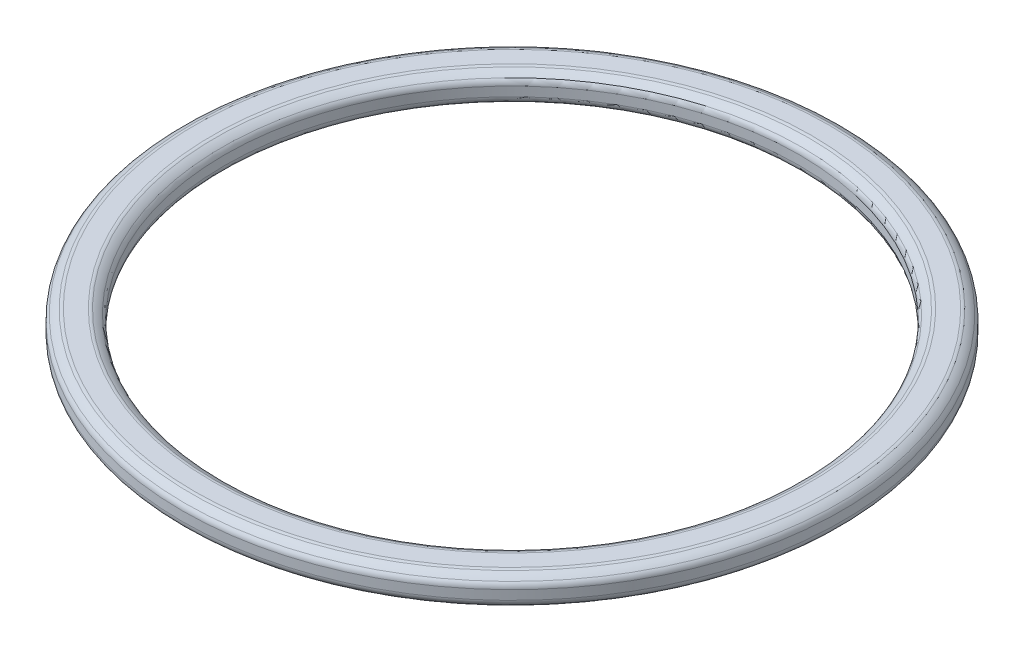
ISO-10303-21;
HEADER;
FILE_DESCRIPTION(('STEP AP214'),'2;1');
FILE_NAME('part.step','',(''),(''),'','','');
FILE_SCHEMA(('AUTOMOTIVE_DESIGN { 1 0 10303 214 1 1 1 1 }'));
ENDSEC;
DATA;
#1=APPLICATION_CONTEXT('core data for automotive mechanical design processes');
#2=APPLICATION_PROTOCOL_DEFINITION('international standard','automotive_design',2000,#1);
#3=PRODUCT_CONTEXT('',#1,'mechanical');
#4=PRODUCT('Part','Part','',(#3));
#5=PRODUCT_RELATED_PRODUCT_CATEGORY('part','',(#4));
#6=PRODUCT_DEFINITION_FORMATION('','',#4);
#7=PRODUCT_DEFINITION_CONTEXT('part definition',#1,'design');
#8=PRODUCT_DEFINITION('design','',#6,#7);
#9=PRODUCT_DEFINITION_SHAPE('','',#8);
#10=(LENGTH_UNIT() NAMED_UNIT(*) SI_UNIT(.MILLI.,.METRE.));
#11=(NAMED_UNIT(*) PLANE_ANGLE_UNIT() SI_UNIT($,.RADIAN.));
#12=(NAMED_UNIT(*) SI_UNIT($,.STERADIAN.) SOLID_ANGLE_UNIT());
#13=UNCERTAINTY_MEASURE_WITH_UNIT(LENGTH_MEASURE(1.E-05),#10,'distance_accuracy_value','');
#14=(GEOMETRIC_REPRESENTATION_CONTEXT(3) GLOBAL_UNCERTAINTY_ASSIGNED_CONTEXT((#13)) GLOBAL_UNIT_ASSIGNED_CONTEXT((#10,
#11,#12)) REPRESENTATION_CONTEXT('',''));
#15=CARTESIAN_POINT('',(0.,0.,0.));
#16=DIRECTION('',(0.,0.,1.));
#17=DIRECTION('',(1.,0.,0.));
#18=AXIS2_PLACEMENT_3D('',#15,#16,#17);
#19=CARTESIAN_POINT('',(14.6,0.72,0.));
#20=DIRECTION('',(0.,0.,1.));
#21=DIRECTION('',(1.,0.,0.));
#22=AXIS2_PLACEMENT_3D('',#19,#20,#21);
#23=ELLIPSE('',#22,1.11111111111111,0.8);
#24=CARTESIAN_POINT('',(0.,0.,0.));
#25=DIRECTION('',(0.,-1.,0.));
#26=AXIS1_PLACEMENT('',#24,#25);
#27=SURFACE_OF_REVOLUTION('',#23,#26);
#28=CARTESIAN_POINT('',(0.,1.41226565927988,0.));
#29=DIRECTION('',(0.,-1.,0.));
#30=DIRECTION('',(0.,0.,-1.));
#31=AXIS2_PLACEMENT_3D('',#28,#29,#30);
#32=CIRCLE('',#31,15.1568877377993);
#33=CARTESIAN_POINT('',(0.,1.41226565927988,-15.1568877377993));
#34=VERTEX_POINT('',#33);
#35=EDGE_CURVE('E64',#34,#34,#32,.T.);
#36=ORIENTED_EDGE('',*,*,#35,.T.);
#37=EDGE_LOOP('',(#36));
#38=FACE_BOUND('',#37,.T.);
#39=CARTESIAN_POINT('',(0.,1.19931669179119,0.));
#40=DIRECTION('',(0.,-1.,0.));
#41=DIRECTION('',(0.,0.,-1.));
#42=AXIS2_PLACEMENT_3D('',#39,#40,#41);
#43=CIRCLE('',#42,15.4895998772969);
#44=CARTESIAN_POINT('',(0.,1.19931669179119,-15.4895998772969));
#45=VERTEX_POINT('',#44);
#46=EDGE_CURVE('E67',#45,#45,#43,.F.);
#47=ORIENTED_EDGE('',*,*,#46,.T.);
#48=EDGE_LOOP('',(#47));
#49=FACE_BOUND('',#48,.T.);
#50=ADVANCED_FACE('F14',(#38,#49),#27,.F.);
#51=CARTESIAN_POINT('',(14.1156778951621,1.44,0.));
#52=DIRECTION('',(0.,1.,0.));
#53=DIRECTION('',(0.,0.,1.));
#54=AXIS2_PLACEMENT_3D('',#51,#52,#53);
#55=PLANE('',#54);
#56=CARTESIAN_POINT('',(0.,1.44,0.));
#57=DIRECTION('',(0.,1.,0.));
#58=DIRECTION('',(0.,0.,1.));
#59=AXIS2_PLACEMENT_3D('',#56,#57,#58);
#60=CIRCLE('',#59,15.0183253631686);
#61=CARTESIAN_POINT('',(0.,1.44,15.0183253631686));
#62=VERTEX_POINT('',#61);
#63=EDGE_CURVE('E58',#62,#62,#60,.T.);
#64=ORIENTED_EDGE('',*,*,#63,.T.);
#65=EDGE_LOOP('',(#64));
#66=FACE_BOUND('',#65,.T.);
#67=CARTESIAN_POINT('',(0.,1.44,0.));
#68=DIRECTION('',(0.,1.,0.));
#69=DIRECTION('',(0.,0.,1.));
#70=AXIS2_PLACEMENT_3D('',#67,#68,#69);
#71=CIRCLE('',#70,14.1816746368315);
#72=CARTESIAN_POINT('',(0.,1.44,14.1816746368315));
#73=VERTEX_POINT('',#72);
#74=EDGE_CURVE('E61',#73,#73,#71,.F.);
#75=ORIENTED_EDGE('',*,*,#74,.T.);
#76=EDGE_LOOP('',(#75));
#77=FACE_BOUND('',#76,.T.);
#78=ADVANCED_FACE('F96',(#66,#77),#55,.T.);
#79=CARTESIAN_POINT('',(14.6,0.72,0.));
#80=DIRECTION('',(0.,0.,1.));
#81=DIRECTION('',(1.,0.,0.));
#82=AXIS2_PLACEMENT_3D('',#79,#80,#81);
#83=ELLIPSE('',#82,1.11111111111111,0.8);
#84=CARTESIAN_POINT('',(0.,0.,0.));
#85=DIRECTION('',(0.,-1.,0.));
#86=AXIS1_PLACEMENT('',#84,#85);
#87=SURFACE_OF_REVOLUTION('',#83,#86);
#88=CARTESIAN_POINT('',(0.,1.41226565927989,0.));
#89=DIRECTION('',(0.,-1.,0.));
#90=DIRECTION('',(0.,0.,-1.));
#91=AXIS2_PLACEMENT_3D('',#88,#89,#90);
#92=CIRCLE('',#91,14.0431122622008);
#93=CARTESIAN_POINT('',(0.,1.41226565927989,-14.0431122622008));
#94=VERTEX_POINT('',#93);
#95=EDGE_CURVE('E52',#94,#94,#92,.F.);
#96=ORIENTED_EDGE('',*,*,#95,.T.);
#97=EDGE_LOOP('',(#96));
#98=FACE_BOUND('',#97,.T.);
#99=CARTESIAN_POINT('',(0.,1.19931669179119,0.));
#100=DIRECTION('',(0.,-1.,0.));
#101=DIRECTION('',(0.,0.,-1.));
#102=AXIS2_PLACEMENT_3D('',#99,#100,#101);
#103=CIRCLE('',#102,13.7104001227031);
#104=CARTESIAN_POINT('',(0.,1.19931669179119,-13.7104001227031));
#105=VERTEX_POINT('',#104);
#106=EDGE_CURVE('E55',#105,#105,#103,.T.);
#107=ORIENTED_EDGE('',*,*,#106,.T.);
#108=EDGE_LOOP('',(#107));
#109=FACE_BOUND('',#108,.T.);
#110=ADVANCED_FACE('F92',(#98,#109),#87,.F.);
#111=CARTESIAN_POINT('',(0.,0.,0.));
#112=DIRECTION('',(0.,-1.,0.));
#113=DIRECTION('',(0.,0.,-1.));
#114=AXIS2_PLACEMENT_3D('',#111,#112,#113);
#115=CYLINDRICAL_SURFACE('',#114,13.6);
#116=CARTESIAN_POINT('',(0.,0.939894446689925,0.));
#117=DIRECTION('',(0.,1.,0.));
#118=DIRECTION('',(0.,0.,1.));
#119=AXIS2_PLACEMENT_3D('',#116,#117,#118);
#120=CIRCLE('',#119,13.6);
#121=CARTESIAN_POINT('',(0.,0.939894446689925,13.6));
#122=VERTEX_POINT('',#121);
#123=EDGE_CURVE('E46',#122,#122,#120,.T.);
#124=ORIENTED_EDGE('',*,*,#123,.T.);
#125=EDGE_LOOP('',(#124));
#126=FACE_BOUND('',#125,.T.);
#127=CARTESIAN_POINT('',(0.,0.500105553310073,0.));
#128=DIRECTION('',(0.,1.,0.));
#129=DIRECTION('',(0.,0.,1.));
#130=AXIS2_PLACEMENT_3D('',#127,#128,#129);
#131=CIRCLE('',#130,13.6);
#132=CARTESIAN_POINT('',(0.,0.500105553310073,13.6));
#133=VERTEX_POINT('',#132);
#134=EDGE_CURVE('E49',#133,#133,#131,.F.);
#135=ORIENTED_EDGE('',*,*,#134,.T.);
#136=EDGE_LOOP('',(#135));
#137=FACE_BOUND('',#136,.T.);
#138=ADVANCED_FACE('F88',(#126,#137),#115,.F.);
#139=CARTESIAN_POINT('',(14.6,0.72,0.));
#140=DIRECTION('',(0.,0.,1.));
#141=DIRECTION('',(1.,0.,0.));
#142=AXIS2_PLACEMENT_3D('',#139,#140,#141);
#143=ELLIPSE('',#142,1.11111111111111,0.8);
#144=CARTESIAN_POINT('',(0.,0.,0.));
#145=DIRECTION('',(0.,-1.,0.));
#146=AXIS1_PLACEMENT('',#144,#145);
#147=SURFACE_OF_REVOLUTION('',#143,#146);
#148=CARTESIAN_POINT('',(0.,0.240683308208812,0.));
#149=DIRECTION('',(0.,-1.,0.));
#150=DIRECTION('',(0.,0.,-1.));
#151=AXIS2_PLACEMENT_3D('',#148,#149,#150);
#152=CIRCLE('',#151,13.7104001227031);
#153=CARTESIAN_POINT('',(0.,0.240683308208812,-13.7104001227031));
#154=VERTEX_POINT('',#153);
#155=EDGE_CURVE('E40',#154,#154,#152,.F.);
#156=ORIENTED_EDGE('',*,*,#155,.T.);
#157=EDGE_LOOP('',(#156));
#158=FACE_BOUND('',#157,.T.);
#159=CARTESIAN_POINT('',(0.,0.0277343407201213,0.));
#160=DIRECTION('',(0.,-1.,0.));
#161=DIRECTION('',(0.,0.,-1.));
#162=AXIS2_PLACEMENT_3D('',#159,#160,#161);
#163=CIRCLE('',#162,14.0431122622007);
#164=CARTESIAN_POINT('',(0.,0.0277343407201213,-14.0431122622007));
#165=VERTEX_POINT('',#164);
#166=EDGE_CURVE('E43',#165,#165,#163,.T.);
#167=ORIENTED_EDGE('',*,*,#166,.T.);
#168=EDGE_LOOP('',(#167));
#169=FACE_BOUND('',#168,.T.);
#170=ADVANCED_FACE('F84',(#158,#169),#147,.F.);
#171=CARTESIAN_POINT('',(14.1156778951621,0.,0.));
#172=DIRECTION('',(0.,-1.,0.));
#173=DIRECTION('',(0.,0.,-1.));
#174=AXIS2_PLACEMENT_3D('',#171,#172,#173);
#175=PLANE('',#174);
#176=CARTESIAN_POINT('',(0.,0.,0.));
#177=DIRECTION('',(0.,-1.,0.));
#178=DIRECTION('',(0.,0.,-1.));
#179=AXIS2_PLACEMENT_3D('',#176,#177,#178);
#180=CIRCLE('',#179,14.1816746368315);
#181=CARTESIAN_POINT('',(0.,0.,-14.1816746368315));
#182=VERTEX_POINT('',#181);
#183=EDGE_CURVE('E34',#182,#182,#180,.F.);
#184=ORIENTED_EDGE('',*,*,#183,.T.);
#185=EDGE_LOOP('',(#184));
#186=FACE_BOUND('',#185,.T.);
#187=CARTESIAN_POINT('',(0.,0.,0.));
#188=DIRECTION('',(0.,-1.,0.));
#189=DIRECTION('',(0.,0.,-1.));
#190=AXIS2_PLACEMENT_3D('',#187,#188,#189);
#191=CIRCLE('',#190,15.0183253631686);
#192=CARTESIAN_POINT('',(0.,0.,-15.0183253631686));
#193=VERTEX_POINT('',#192);
#194=EDGE_CURVE('E37',#193,#193,#191,.T.);
#195=ORIENTED_EDGE('',*,*,#194,.T.);
#196=EDGE_LOOP('',(#195));
#197=FACE_BOUND('',#196,.T.);
#198=ADVANCED_FACE('F80',(#186,#197),#175,.T.);
#199=CARTESIAN_POINT('',(14.6,0.72,0.));
#200=DIRECTION('',(0.,0.,1.));
#201=DIRECTION('',(1.,0.,0.));
#202=AXIS2_PLACEMENT_3D('',#199,#200,#201);
#203=ELLIPSE('',#202,1.11111111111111,0.8);
#204=CARTESIAN_POINT('',(0.,0.,0.));
#205=DIRECTION('',(0.,-1.,0.));
#206=AXIS1_PLACEMENT('',#204,#205);
#207=SURFACE_OF_REVOLUTION('',#203,#206);
#208=CARTESIAN_POINT('',(0.,0.0277343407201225,0.));
#209=DIRECTION('',(0.,-1.,0.));
#210=DIRECTION('',(0.,0.,-1.));
#211=AXIS2_PLACEMENT_3D('',#208,#209,#210);
#212=CIRCLE('',#211,15.1568877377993);
#213=CARTESIAN_POINT('',(0.,0.0277343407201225,-15.1568877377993));
#214=VERTEX_POINT('',#213);
#215=EDGE_CURVE('E25',#214,#214,#212,.F.);
#216=ORIENTED_EDGE('',*,*,#215,.T.);
#217=EDGE_LOOP('',(#216));
#218=FACE_BOUND('',#217,.T.);
#219=CARTESIAN_POINT('',(0.,0.240683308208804,0.));
#220=DIRECTION('',(0.,-1.,0.));
#221=DIRECTION('',(0.,0.,-1.));
#222=AXIS2_PLACEMENT_3D('',#219,#220,#221);
#223=CIRCLE('',#222,15.4895998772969);
#224=CARTESIAN_POINT('',(0.,0.240683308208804,-15.4895998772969));
#225=VERTEX_POINT('',#224);
#226=EDGE_CURVE('E29',#225,#225,#223,.T.);
#227=ORIENTED_EDGE('',*,*,#226,.T.);
#228=EDGE_LOOP('',(#227));
#229=FACE_BOUND('',#228,.T.);
#230=ADVANCED_FACE('F75',(#218,#229),#207,.F.);
#231=CARTESIAN_POINT('',(0.,0.,0.));
#232=DIRECTION('',(0.,-1.,0.));
#233=DIRECTION('',(0.,0.,-1.));
#234=AXIS2_PLACEMENT_3D('',#231,#232,#233);
#235=CYLINDRICAL_SURFACE('',#234,15.6);
#236=CARTESIAN_POINT('',(0.,0.50010555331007,0.));
#237=DIRECTION('',(0.,1.,0.));
#238=DIRECTION('',(0.,0.,1.));
#239=AXIS2_PLACEMENT_3D('',#236,#237,#238);
#240=CIRCLE('',#239,15.6);
#241=CARTESIAN_POINT('',(0.,0.50010555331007,15.6));
#242=VERTEX_POINT('',#241);
#243=EDGE_CURVE('E10',#242,#242,#240,.T.);
#244=ORIENTED_EDGE('',*,*,#243,.T.);
#245=EDGE_LOOP('',(#244));
#246=FACE_BOUND('',#245,.T.);
#247=CARTESIAN_POINT('',(0.,0.939894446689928,0.));
#248=DIRECTION('',(0.,1.,0.));
#249=DIRECTION('',(0.,0.,1.));
#250=AXIS2_PLACEMENT_3D('',#247,#248,#249);
#251=CIRCLE('',#250,15.6);
#252=CARTESIAN_POINT('',(0.,0.939894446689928,15.6));
#253=VERTEX_POINT('',#252);
#254=EDGE_CURVE('E21',#253,#253,#251,.F.);
#255=ORIENTED_EDGE('',*,*,#254,.T.);
#256=EDGE_LOOP('',(#255));
#257=FACE_BOUND('',#256,.T.);
#258=ADVANCED_FACE('F79',(#246,#257),#235,.T.);
#259=CARTESIAN_POINT('',(0.,1.08,0.));
#260=DIRECTION('',(0.,-1.,0.));
#261=DIRECTION('',(0.,0.,-1.));
#262=AXIS2_PLACEMENT_3D('',#259,#260,#261);
#263=TOROIDAL_SURFACE('',#262,15.0183253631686,0.36);
#264=ORIENTED_EDGE('',*,*,#63,.F.);
#265=EDGE_LOOP('',(#264));
#266=FACE_BOUND('',#265,.T.);
#267=ORIENTED_EDGE('',*,*,#35,.F.);
#268=EDGE_LOOP('',(#267));
#269=FACE_BOUND('',#268,.T.);
#270=ADVANCED_FACE('F105',(#266,#269),#263,.T.);
#271=CARTESIAN_POINT('',(0.,1.08,0.));
#272=DIRECTION('',(0.,-1.,0.));
#273=DIRECTION('',(0.,0.,-1.));
#274=AXIS2_PLACEMENT_3D('',#271,#272,#273);
#275=TOROIDAL_SURFACE('',#274,14.1816746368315,0.36);
#276=ORIENTED_EDGE('',*,*,#95,.F.);
#277=EDGE_LOOP('',(#276));
#278=FACE_BOUND('',#277,.T.);
#279=ORIENTED_EDGE('',*,*,#74,.F.);
#280=EDGE_LOOP('',(#279));
#281=FACE_BOUND('',#280,.T.);
#282=ADVANCED_FACE('F108',(#278,#281),#275,.T.);
#283=CARTESIAN_POINT('',(0.,0.939894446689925,0.));
#284=DIRECTION('',(0.,1.,0.));
#285=DIRECTION('',(0.,0.,1.));
#286=AXIS2_PLACEMENT_3D('',#283,#284,#285);
#287=TOROIDAL_SURFACE('',#286,13.96,0.36);
#288=ORIENTED_EDGE('',*,*,#123,.F.);
#289=EDGE_LOOP('',(#288));
#290=FACE_BOUND('',#289,.T.);
#291=ORIENTED_EDGE('',*,*,#106,.F.);
#292=EDGE_LOOP('',(#291));
#293=FACE_BOUND('',#292,.T.);
#294=ADVANCED_FACE('F112',(#290,#293),#287,.T.);
#295=CARTESIAN_POINT('',(0.,0.500105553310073,0.));
#296=DIRECTION('',(0.,1.,0.));
#297=DIRECTION('',(0.,0.,1.));
#298=AXIS2_PLACEMENT_3D('',#295,#296,#297);
#299=TOROIDAL_SURFACE('',#298,13.96,0.36);
#300=ORIENTED_EDGE('',*,*,#155,.F.);
#301=EDGE_LOOP('',(#300));
#302=FACE_BOUND('',#301,.T.);
#303=ORIENTED_EDGE('',*,*,#134,.F.);
#304=EDGE_LOOP('',(#303));
#305=FACE_BOUND('',#304,.T.);
#306=ADVANCED_FACE('F116',(#302,#305),#299,.T.);
#307=CARTESIAN_POINT('',(0.,0.360000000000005,0.));
#308=DIRECTION('',(0.,-1.,0.));
#309=DIRECTION('',(0.,0.,-1.));
#310=AXIS2_PLACEMENT_3D('',#307,#308,#309);
#311=TOROIDAL_SURFACE('',#310,14.1816746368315,0.36);
#312=ORIENTED_EDGE('',*,*,#183,.F.);
#313=EDGE_LOOP('',(#312));
#314=FACE_BOUND('',#313,.T.);
#315=ORIENTED_EDGE('',*,*,#166,.F.);
#316=EDGE_LOOP('',(#315));
#317=FACE_BOUND('',#316,.T.);
#318=ADVANCED_FACE('F120',(#314,#317),#311,.T.);
#319=CARTESIAN_POINT('',(0.,0.360000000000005,0.));
#320=DIRECTION('',(0.,-1.,0.));
#321=DIRECTION('',(0.,0.,-1.));
#322=AXIS2_PLACEMENT_3D('',#319,#320,#321);
#323=TOROIDAL_SURFACE('',#322,15.0183253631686,0.36);
#324=ORIENTED_EDGE('',*,*,#215,.F.);
#325=EDGE_LOOP('',(#324));
#326=FACE_BOUND('',#325,.T.);
#327=ORIENTED_EDGE('',*,*,#194,.F.);
#328=EDGE_LOOP('',(#327));
#329=FACE_BOUND('',#328,.T.);
#330=ADVANCED_FACE('F124',(#326,#329),#323,.T.);
#331=CARTESIAN_POINT('',(0.,0.50010555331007,0.));
#332=DIRECTION('',(0.,1.,0.));
#333=DIRECTION('',(0.,0.,1.));
#334=AXIS2_PLACEMENT_3D('',#331,#332,#333);
#335=TOROIDAL_SURFACE('',#334,15.24,0.36);
#336=ORIENTED_EDGE('',*,*,#243,.F.);
#337=EDGE_LOOP('',(#336));
#338=FACE_BOUND('',#337,.T.);
#339=ORIENTED_EDGE('',*,*,#226,.F.);
#340=EDGE_LOOP('',(#339));
#341=FACE_BOUND('',#340,.T.);
#342=ADVANCED_FACE('F127',(#338,#341),#335,.T.);
#343=CARTESIAN_POINT('',(0.,0.939894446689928,0.));
#344=DIRECTION('',(0.,1.,0.));
#345=DIRECTION('',(0.,0.,1.));
#346=AXIS2_PLACEMENT_3D('',#343,#344,#345);
#347=TOROIDAL_SURFACE('',#346,15.24,0.36);
#348=ORIENTED_EDGE('',*,*,#46,.F.);
#349=EDGE_LOOP('',(#348));
#350=FACE_BOUND('',#349,.T.);
#351=ORIENTED_EDGE('',*,*,#254,.F.);
#352=EDGE_LOOP('',(#351));
#353=FACE_BOUND('',#352,.T.);
#354=ADVANCED_FACE('F16',(#350,#353),#347,.T.);
#355=CLOSED_SHELL('',(#50,#78,#110,#138,#170,#198,#230,#258,#270,#282,#294,#306,#318,#330,#342,#354));
#356=MANIFOLD_SOLID_BREP('B1',#355);
#357=ADVANCED_BREP_SHAPE_REPRESENTATION('',(#18,#356),#14);
#358=SHAPE_DEFINITION_REPRESENTATION(#9,#357);
ENDSEC;
END-ISO-10303-21;
